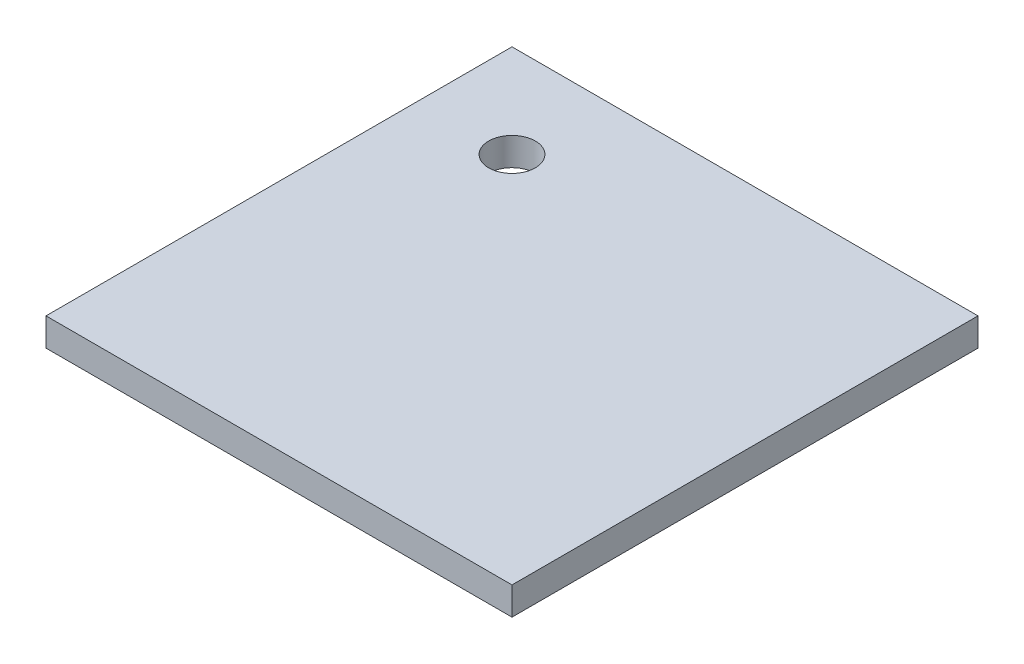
ISO-10303-21;
HEADER;
FILE_DESCRIPTION(('STEP AP214'),'2;1');
FILE_NAME('part.step','',(''),(''),'','','');
FILE_SCHEMA(('AUTOMOTIVE_DESIGN { 1 0 10303 214 1 1 1 1 }'));
ENDSEC;
DATA;
#1=APPLICATION_CONTEXT('core data for automotive mechanical design processes');
#2=APPLICATION_PROTOCOL_DEFINITION('international standard','automotive_design',2000,#1);
#3=PRODUCT_CONTEXT('',#1,'mechanical');
#4=PRODUCT('Part','Part','',(#3));
#5=PRODUCT_RELATED_PRODUCT_CATEGORY('part','',(#4));
#6=PRODUCT_DEFINITION_FORMATION('','',#4);
#7=PRODUCT_DEFINITION_CONTEXT('part definition',#1,'design');
#8=PRODUCT_DEFINITION('design','',#6,#7);
#9=PRODUCT_DEFINITION_SHAPE('','',#8);
#10=(LENGTH_UNIT() NAMED_UNIT(*) SI_UNIT(.MILLI.,.METRE.));
#11=(NAMED_UNIT(*) PLANE_ANGLE_UNIT() SI_UNIT($,.RADIAN.));
#12=(NAMED_UNIT(*) SI_UNIT($,.STERADIAN.) SOLID_ANGLE_UNIT());
#13=UNCERTAINTY_MEASURE_WITH_UNIT(LENGTH_MEASURE(1.E-05),#10,'distance_accuracy_value','');
#14=(GEOMETRIC_REPRESENTATION_CONTEXT(3) GLOBAL_UNCERTAINTY_ASSIGNED_CONTEXT((#13)) GLOBAL_UNIT_ASSIGNED_CONTEXT((#10,
#11,#12)) REPRESENTATION_CONTEXT('',''));
#15=CARTESIAN_POINT('',(0.,0.,0.));
#16=DIRECTION('',(0.,0.,1.));
#17=DIRECTION('',(1.,0.,0.));
#18=AXIS2_PLACEMENT_3D('',#15,#16,#17);
#19=CARTESIAN_POINT('',(0.,0.,1000.));
#20=DIRECTION('',(1.,0.,0.));
#21=DIRECTION('',(0.,0.,-1.));
#22=AXIS2_PLACEMENT_3D('',#19,#20,#21);
#23=PLANE('',#22);
#24=DIRECTION('',(0.,-1.,0.));
#25=VECTOR('',#24,1.);
#26=CARTESIAN_POINT('',(0.,0.,0.));
#27=LINE('',#26,#25);
#28=CARTESIAN_POINT('',(0.,60.,0.));
#29=VERTEX_POINT('',#28);
#30=CARTESIAN_POINT('',(0.,0.,0.));
#31=VERTEX_POINT('',#30);
#32=EDGE_CURVE('E96',#29,#31,#27,.T.);
#33=ORIENTED_EDGE('',*,*,#32,.T.);
#34=DIRECTION('',(0.,0.,-1.));
#35=VECTOR('',#34,1.);
#36=CARTESIAN_POINT('',(0.,0.,1000.));
#37=LINE('',#36,#35);
#38=CARTESIAN_POINT('',(0.,0.,1000.));
#39=VERTEX_POINT('',#38);
#40=EDGE_CURVE('E11',#39,#31,#37,.T.);
#41=ORIENTED_EDGE('',*,*,#40,.F.);
#42=DIRECTION('',(0.,-1.,0.));
#43=VECTOR('',#42,1.);
#44=CARTESIAN_POINT('',(0.,0.,1000.));
#45=LINE('',#44,#43);
#46=CARTESIAN_POINT('',(0.,60.,1000.));
#47=VERTEX_POINT('',#46);
#48=EDGE_CURVE('E84',#47,#39,#45,.T.);
#49=ORIENTED_EDGE('',*,*,#48,.F.);
#50=DIRECTION('',(0.,0.,-1.));
#51=VECTOR('',#50,1.);
#52=CARTESIAN_POINT('',(0.,60.,1000.));
#53=LINE('',#52,#51);
#54=EDGE_CURVE('E92',#47,#29,#53,.T.);
#55=ORIENTED_EDGE('',*,*,#54,.T.);
#56=EDGE_LOOP('',(#33,#41,#49,#55));
#57=FACE_BOUND('',#56,.T.);
#58=ADVANCED_FACE('F33',(#57),#23,.F.);
#59=CARTESIAN_POINT('',(0.,0.,1000.));
#60=DIRECTION('',(0.,1.,0.));
#61=DIRECTION('',(0.,0.,1.));
#62=AXIS2_PLACEMENT_3D('',#59,#60,#61);
#63=PLANE('',#62);
#64=CARTESIAN_POINT('',(200.,0.,200.));
#65=DIRECTION('',(0.,1.,0.));
#66=DIRECTION('',(0.,0.,1.));
#67=AXIS2_PLACEMENT_3D('',#64,#65,#66);
#68=CIRCLE('',#67,50.);
#69=CARTESIAN_POINT('',(200.,0.,250.));
#70=VERTEX_POINT('',#69);
#71=EDGE_CURVE('E99',#70,#70,#68,.T.);
#72=ORIENTED_EDGE('',*,*,#71,.T.);
#73=EDGE_LOOP('',(#72));
#74=FACE_BOUND('',#73,.T.);
#75=DIRECTION('',(1.,0.,0.));
#76=VECTOR('',#75,1.);
#77=CARTESIAN_POINT('',(0.,0.,0.));
#78=LINE('',#77,#76);
#79=CARTESIAN_POINT('',(1000.,0.,0.));
#80=VERTEX_POINT('',#79);
#81=EDGE_CURVE('E88',#31,#80,#78,.T.);
#82=ORIENTED_EDGE('',*,*,#81,.T.);
#83=DIRECTION('',(0.,0.,-1.));
#84=VECTOR('',#83,1.);
#85=CARTESIAN_POINT('',(1000.,0.,1000.));
#86=LINE('',#85,#84);
#87=CARTESIAN_POINT('',(1000.,0.,1000.));
#88=VERTEX_POINT('',#87);
#89=EDGE_CURVE('E41',#88,#80,#86,.T.);
#90=ORIENTED_EDGE('',*,*,#89,.F.);
#91=DIRECTION('',(1.,0.,0.));
#92=VECTOR('',#91,1.);
#93=CARTESIAN_POINT('',(0.,0.,1000.));
#94=LINE('',#93,#92);
#95=EDGE_CURVE('E79',#39,#88,#94,.T.);
#96=ORIENTED_EDGE('',*,*,#95,.F.);
#97=ORIENTED_EDGE('',*,*,#40,.T.);
#98=EDGE_LOOP('',(#82,#90,#96,#97));
#99=FACE_BOUND('',#98,.T.);
#100=ADVANCED_FACE('F87',(#74,#99),#63,.F.);
#101=CARTESIAN_POINT('',(1000.,0.,1000.));
#102=DIRECTION('',(-1.,0.,0.));
#103=DIRECTION('',(0.,0.,1.));
#104=AXIS2_PLACEMENT_3D('',#101,#102,#103);
#105=PLANE('',#104);
#106=DIRECTION('',(0.,1.,0.));
#107=VECTOR('',#106,1.);
#108=CARTESIAN_POINT('',(1000.,0.,0.));
#109=LINE('',#108,#107);
#110=CARTESIAN_POINT('',(1000.,60.,0.));
#111=VERTEX_POINT('',#110);
#112=EDGE_CURVE('E66',#80,#111,#109,.T.);
#113=ORIENTED_EDGE('',*,*,#112,.T.);
#114=DIRECTION('',(0.,0.,-1.));
#115=VECTOR('',#114,1.);
#116=CARTESIAN_POINT('',(1000.,60.,1000.));
#117=LINE('',#116,#115);
#118=CARTESIAN_POINT('',(1000.,60.,1000.));
#119=VERTEX_POINT('',#118);
#120=EDGE_CURVE('E89',#119,#111,#117,.T.);
#121=ORIENTED_EDGE('',*,*,#120,.F.);
#122=DIRECTION('',(0.,1.,0.));
#123=VECTOR('',#122,1.);
#124=CARTESIAN_POINT('',(1000.,0.,1000.));
#125=LINE('',#124,#123);
#126=EDGE_CURVE('E82',#88,#119,#125,.T.);
#127=ORIENTED_EDGE('',*,*,#126,.F.);
#128=ORIENTED_EDGE('',*,*,#89,.T.);
#129=EDGE_LOOP('',(#113,#121,#127,#128));
#130=FACE_BOUND('',#129,.T.);
#131=ADVANCED_FACE('F90',(#130),#105,.F.);
#132=CARTESIAN_POINT('',(0.,60.,1000.));
#133=DIRECTION('',(0.,-1.,0.));
#134=DIRECTION('',(0.,0.,-1.));
#135=AXIS2_PLACEMENT_3D('',#132,#133,#134);
#136=PLANE('',#135);
#137=CARTESIAN_POINT('',(200.,60.,200.));
#138=DIRECTION('',(0.,1.,0.));
#139=DIRECTION('',(0.,0.,1.));
#140=AXIS2_PLACEMENT_3D('',#137,#138,#139);
#141=CIRCLE('',#140,50.);
#142=CARTESIAN_POINT('',(200.,60.,250.));
#143=VERTEX_POINT('',#142);
#144=EDGE_CURVE('E110',#143,#143,#141,.T.);
#145=ORIENTED_EDGE('',*,*,#144,.F.);
#146=EDGE_LOOP('',(#145));
#147=FACE_BOUND('',#146,.T.);
#148=DIRECTION('',(-1.,0.,0.));
#149=VECTOR('',#148,1.);
#150=CARTESIAN_POINT('',(0.,60.,0.));
#151=LINE('',#150,#149);
#152=EDGE_CURVE('E72',#111,#29,#151,.T.);
#153=ORIENTED_EDGE('',*,*,#152,.T.);
#154=ORIENTED_EDGE('',*,*,#54,.F.);
#155=DIRECTION('',(-1.,0.,0.));
#156=VECTOR('',#155,1.);
#157=CARTESIAN_POINT('',(0.,60.,1000.));
#158=LINE('',#157,#156);
#159=EDGE_CURVE('E49',#119,#47,#158,.T.);
#160=ORIENTED_EDGE('',*,*,#159,.F.);
#161=ORIENTED_EDGE('',*,*,#120,.T.);
#162=EDGE_LOOP('',(#153,#154,#160,#161));
#163=FACE_BOUND('',#162,.T.);
#164=ADVANCED_FACE('F104',(#147,#163),#136,.F.);
#165=CARTESIAN_POINT('',(0.,60.,1000.));
#166=DIRECTION('',(0.,0.,-1.));
#167=DIRECTION('',(-1.,0.,0.));
#168=AXIS2_PLACEMENT_3D('',#165,#166,#167);
#169=PLANE('',#168);
#170=ORIENTED_EDGE('',*,*,#48,.T.);
#171=ORIENTED_EDGE('',*,*,#95,.T.);
#172=ORIENTED_EDGE('',*,*,#126,.T.);
#173=ORIENTED_EDGE('',*,*,#159,.T.);
#174=EDGE_LOOP('',(#170,#171,#172,#173));
#175=FACE_BOUND('',#174,.T.);
#176=ADVANCED_FACE('F80',(#175),#169,.F.);
#177=CARTESIAN_POINT('',(0.,60.,0.));
#178=DIRECTION('',(0.,0.,-1.));
#179=DIRECTION('',(-1.,0.,0.));
#180=AXIS2_PLACEMENT_3D('',#177,#178,#179);
#181=PLANE('',#180);
#182=ORIENTED_EDGE('',*,*,#32,.F.);
#183=ORIENTED_EDGE('',*,*,#152,.F.);
#184=ORIENTED_EDGE('',*,*,#112,.F.);
#185=ORIENTED_EDGE('',*,*,#81,.F.);
#186=EDGE_LOOP('',(#182,#183,#184,#185));
#187=FACE_BOUND('',#186,.T.);
#188=ADVANCED_FACE('F107',(#187),#181,.T.);
#189=CARTESIAN_POINT('',(200.,0.,200.));
#190=DIRECTION('',(0.,1.,0.));
#191=DIRECTION('',(0.,0.,1.));
#192=AXIS2_PLACEMENT_3D('',#189,#190,#191);
#193=CYLINDRICAL_SURFACE('',#192,50.);
#194=ORIENTED_EDGE('',*,*,#71,.F.);
#195=EDGE_LOOP('',(#194));
#196=FACE_BOUND('',#195,.T.);
#197=ORIENTED_EDGE('',*,*,#144,.T.);
#198=EDGE_LOOP('',(#197));
#199=FACE_BOUND('',#198,.T.);
#200=ADVANCED_FACE('F117',(#196,#199),#193,.F.);
#201=CLOSED_SHELL('',(#58,#100,#131,#164,#176,#188,#200));
#202=MANIFOLD_SOLID_BREP('B2',#201);
#203=ADVANCED_BREP_SHAPE_REPRESENTATION('',(#18,#202),#14);
#204=SHAPE_DEFINITION_REPRESENTATION(#9,#203);
ENDSEC;
END-ISO-10303-21;
